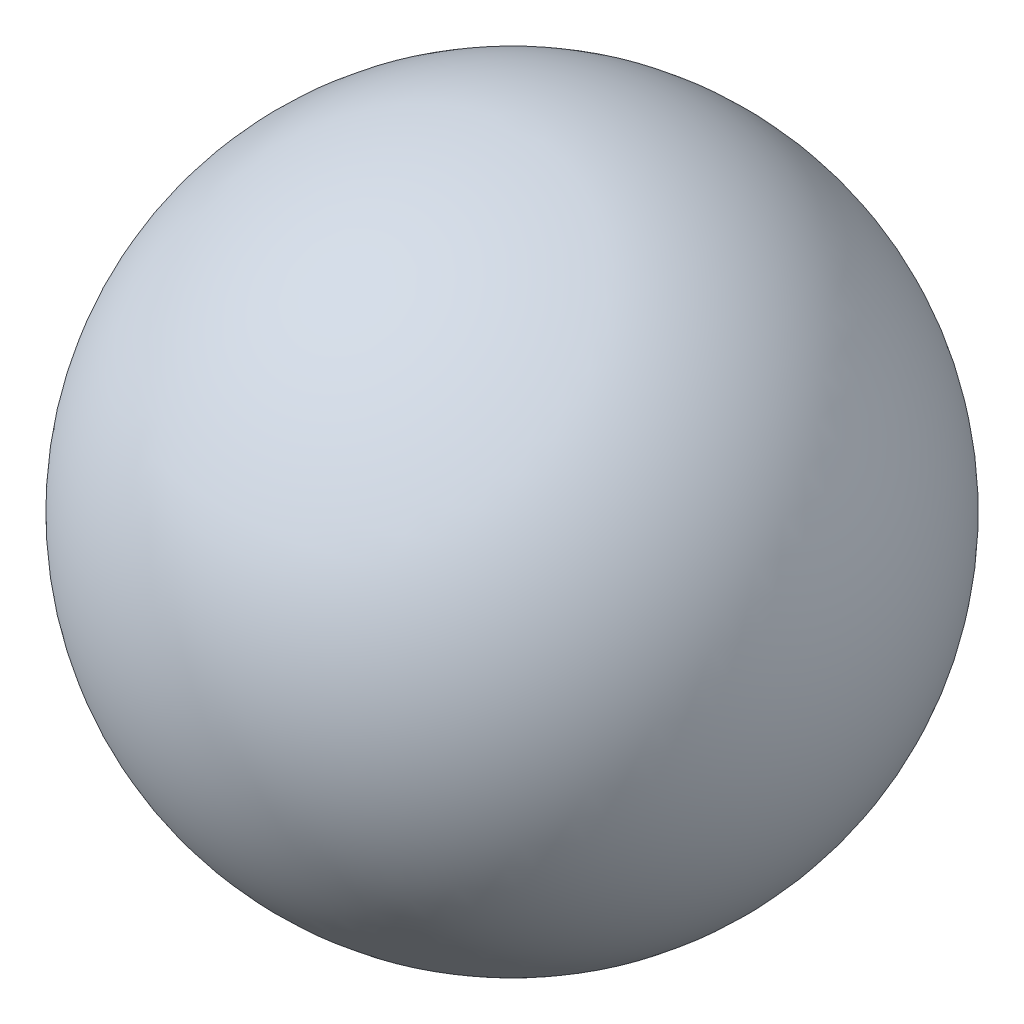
from build123d import *


with BuildPart() as part:
    # Sketch1 → Revolve1 (revolve)
    with BuildSketch(Plane.XY):
        with BuildLine():
            Line((0, 1.984375), (0, -1.984375))
            ThreePointArc((0, -1.984375), (-1.984375, 0), (0, 1.984375))
        make_face()
    revolve(axis=Axis((0, 1.984375, 0), (0, -1, 0)))


solid = part.part
